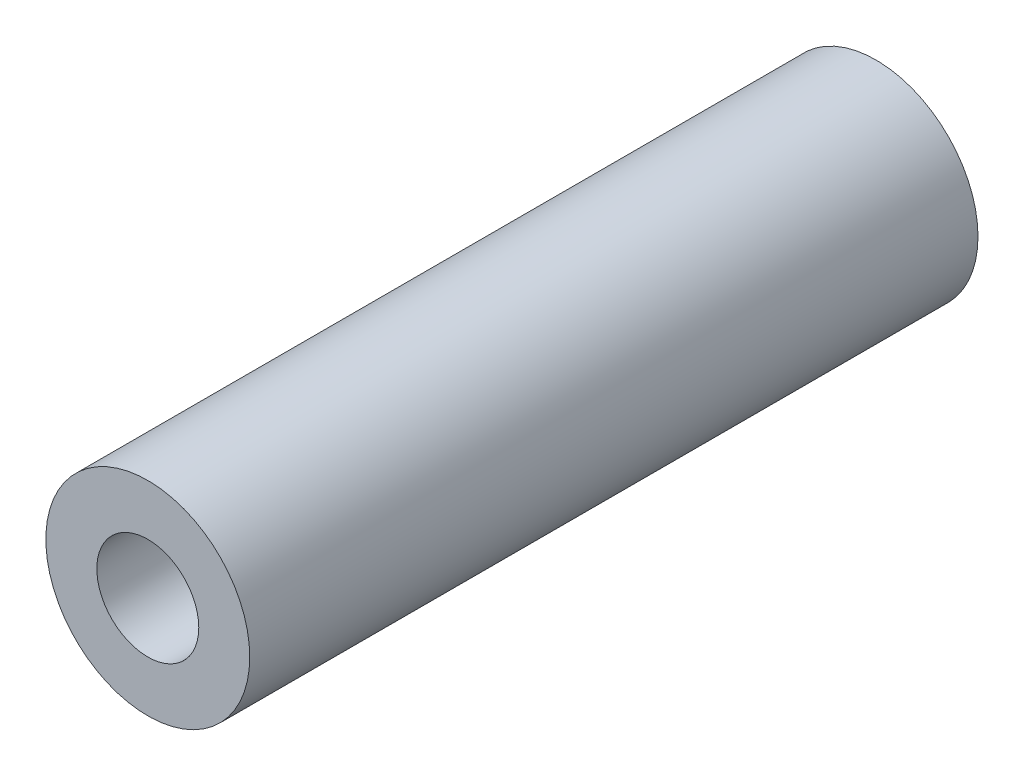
from build123d import *

# Parameters (mm, degrees)
ESQUISSE1_R             = 3.5
BASE_EXTRUSION_DEPTH    = 25
ESQUISSE2_R             = 1.75
ENL_V_MAT_EXTRU_1_DEPTH = 26.485289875


with BuildPart() as part:
    # Esquisse1 → Base-Extrusion (new body)
    with BuildSketch(Plane.XY):
        Circle(ESQUISSE1_R)
    extrude(amount=BASE_EXTRUSION_DEPTH)

    # Esquisse2 → Enl_v. mat.-Extru.1 (cut, through all)
    with BuildSketch(Plane.XY.offset(25)):
        Circle(ESQUISSE2_R)
    extrude(amount=-ENL_V_MAT_EXTRU_1_DEPTH, mode=Mode.SUBTRACT)


solid = part.part
